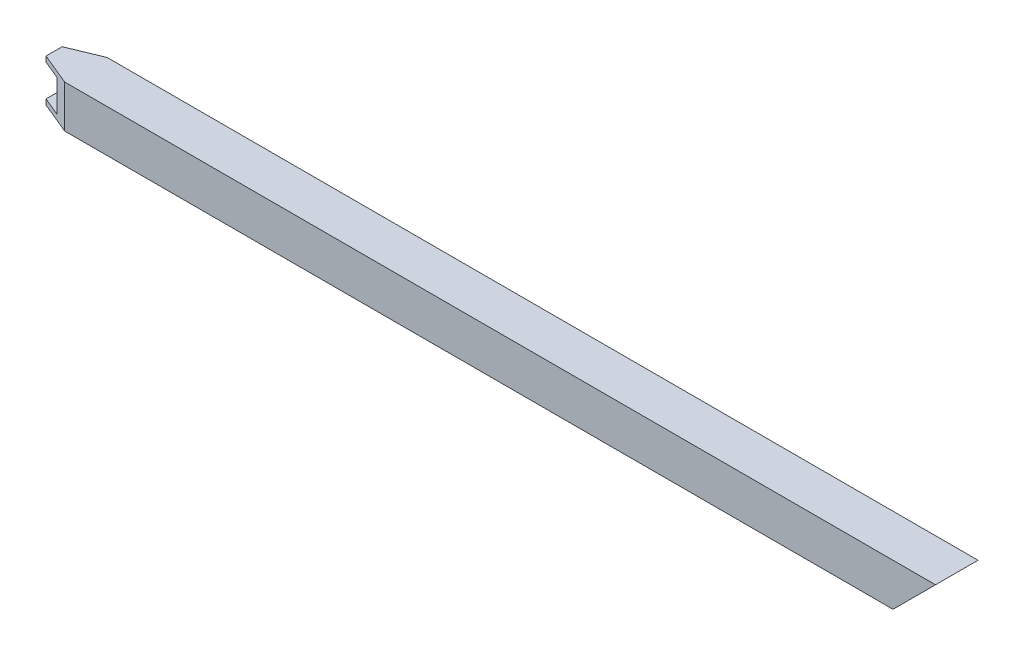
ISO-10303-21;
HEADER;
FILE_DESCRIPTION(('STEP AP214'),'2;1');
FILE_NAME('part.step','',(''),(''),'','','');
FILE_SCHEMA(('AUTOMOTIVE_DESIGN { 1 0 10303 214 1 1 1 1 }'));
ENDSEC;
DATA;
#1=APPLICATION_CONTEXT('core data for automotive mechanical design processes');
#2=APPLICATION_PROTOCOL_DEFINITION('international standard','automotive_design',2000,#1);
#3=PRODUCT_CONTEXT('',#1,'mechanical');
#4=PRODUCT('Part','Part','',(#3));
#5=PRODUCT_RELATED_PRODUCT_CATEGORY('part','',(#4));
#6=PRODUCT_DEFINITION_FORMATION('','',#4);
#7=PRODUCT_DEFINITION_CONTEXT('part definition',#1,'design');
#8=PRODUCT_DEFINITION('design','',#6,#7);
#9=PRODUCT_DEFINITION_SHAPE('','',#8);
#10=(LENGTH_UNIT() NAMED_UNIT(*) SI_UNIT(.MILLI.,.METRE.));
#11=(NAMED_UNIT(*) PLANE_ANGLE_UNIT() SI_UNIT($,.RADIAN.));
#12=(NAMED_UNIT(*) SI_UNIT($,.STERADIAN.) SOLID_ANGLE_UNIT());
#13=UNCERTAINTY_MEASURE_WITH_UNIT(LENGTH_MEASURE(1.E-05),#10,'distance_accuracy_value','');
#14=(GEOMETRIC_REPRESENTATION_CONTEXT(3) GLOBAL_UNCERTAINTY_ASSIGNED_CONTEXT((#13)) GLOBAL_UNIT_ASSIGNED_CONTEXT((#10,
#11,#12)) REPRESENTATION_CONTEXT('',''));
#15=CARTESIAN_POINT('',(0.,0.,0.));
#16=DIRECTION('',(0.,0.,1.));
#17=DIRECTION('',(1.,0.,0.));
#18=AXIS2_PLACEMENT_3D('',#15,#16,#17);
#19=CARTESIAN_POINT('',(539.75,-12.7,-12.7));
#20=DIRECTION('',(0.,0.,1.));
#21=DIRECTION('',(1.,0.,0.));
#22=AXIS2_PLACEMENT_3D('',#19,#20,#21);
#23=PLANE('',#22);
#24=DIRECTION('',(0.,1.,0.));
#25=VECTOR('',#24,1.);
#26=CARTESIAN_POINT('',(19.05,-12.7,-12.7));
#27=LINE('',#26,#25);
#28=CARTESIAN_POINT('',(19.05,-12.7,-12.7));
#29=VERTEX_POINT('',#28);
#30=CARTESIAN_POINT('',(19.05,12.7,-12.7));
#31=VERTEX_POINT('',#30);
#32=EDGE_CURVE('E119',#29,#31,#27,.T.);
#33=ORIENTED_EDGE('',*,*,#32,.T.);
#34=DIRECTION('',(-1.,0.,0.));
#35=VECTOR('',#34,1.);
#36=CARTESIAN_POINT('',(539.75,12.7,-12.7));
#37=LINE('',#36,#35);
#38=CARTESIAN_POINT('',(539.75,12.7,-12.7));
#39=VERTEX_POINT('',#38);
#40=EDGE_CURVE('E40',#39,#31,#37,.T.);
#41=ORIENTED_EDGE('',*,*,#40,.F.);
#42=DIRECTION('',(-0.707106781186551,-0.707106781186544,0.));
#43=VECTOR('',#42,1.);
#44=CARTESIAN_POINT('',(539.75,12.7,-12.7));
#45=LINE('',#44,#43);
#46=CARTESIAN_POINT('',(514.35,-12.7,-12.7));
#47=VERTEX_POINT('',#46);
#48=EDGE_CURVE('E143',#39,#47,#45,.T.);
#49=ORIENTED_EDGE('',*,*,#48,.T.);
#50=DIRECTION('',(-1.,0.,0.));
#51=VECTOR('',#50,1.);
#52=CARTESIAN_POINT('',(539.75,-12.7,-12.7));
#53=LINE('',#52,#51);
#54=EDGE_CURVE('E137',#47,#29,#53,.T.);
#55=ORIENTED_EDGE('',*,*,#54,.T.);
#56=EDGE_LOOP('',(#33,#41,#49,#55));
#57=FACE_BOUND('',#56,.T.);
#58=ADVANCED_FACE('F33',(#57),#23,.F.);
#59=CARTESIAN_POINT('',(539.75,-12.7,12.7));
#60=DIRECTION('',(0.,0.,-1.));
#61=DIRECTION('',(-1.,0.,0.));
#62=AXIS2_PLACEMENT_3D('',#59,#60,#61);
#63=PLANE('',#62);
#64=DIRECTION('',(0.,1.,0.));
#65=VECTOR('',#64,1.);
#66=CARTESIAN_POINT('',(19.05,-12.7,12.7));
#67=LINE('',#66,#65);
#68=CARTESIAN_POINT('',(19.05,-12.7,12.7));
#69=VERTEX_POINT('',#68);
#70=CARTESIAN_POINT('',(19.0500000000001,12.7,12.7));
#71=VERTEX_POINT('',#70);
#72=EDGE_CURVE('E47',#69,#71,#67,.T.);
#73=ORIENTED_EDGE('',*,*,#72,.F.);
#74=DIRECTION('',(-1.,0.,0.));
#75=VECTOR('',#74,1.);
#76=CARTESIAN_POINT('',(539.75,-12.7,12.7));
#77=LINE('',#76,#75);
#78=CARTESIAN_POINT('',(514.35,-12.7,12.7));
#79=VERTEX_POINT('',#78);
#80=EDGE_CURVE('E144',#79,#69,#77,.T.);
#81=ORIENTED_EDGE('',*,*,#80,.F.);
#82=DIRECTION('',(-0.707106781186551,-0.707106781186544,0.));
#83=VECTOR('',#82,1.);
#84=CARTESIAN_POINT('',(539.75,12.7,12.7));
#85=LINE('',#84,#83);
#86=CARTESIAN_POINT('',(539.75,12.7,12.7));
#87=VERTEX_POINT('',#86);
#88=EDGE_CURVE('E164',#87,#79,#85,.T.);
#89=ORIENTED_EDGE('',*,*,#88,.F.);
#90=DIRECTION('',(-1.,0.,0.));
#91=VECTOR('',#90,1.);
#92=CARTESIAN_POINT('',(539.75,12.7,12.7));
#93=LINE('',#92,#91);
#94=EDGE_CURVE('E148',#87,#71,#93,.T.);
#95=ORIENTED_EDGE('',*,*,#94,.T.);
#96=EDGE_LOOP('',(#73,#81,#89,#95));
#97=FACE_BOUND('',#96,.T.);
#98=ADVANCED_FACE('F167',(#97),#63,.F.);
#99=CARTESIAN_POINT('',(539.75,-12.7,12.7));
#100=DIRECTION('',(0.,1.,0.));
#101=DIRECTION('',(0.,0.,1.));
#102=AXIS2_PLACEMENT_3D('',#99,#100,#101);
#103=PLANE('',#102);
#104=DIRECTION('',(0.923879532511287,0.,0.382683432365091));
#105=VECTOR('',#104,1.);
#106=CARTESIAN_POINT('',(19.05,-12.7,12.7));
#107=LINE('',#106,#105);
#108=CARTESIAN_POINT('',(0.,-12.7,4.80923163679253));
#109=VERTEX_POINT('',#108);
#110=EDGE_CURVE('E129',#109,#69,#107,.T.);
#111=ORIENTED_EDGE('',*,*,#110,.F.);
#112=DIRECTION('',(0.,0.,-1.));
#113=VECTOR('',#112,1.);
#114=CARTESIAN_POINT('',(0.,-12.7,12.7));
#115=LINE('',#114,#113);
#116=CARTESIAN_POINT('',(0.,-12.7,-4.80923163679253));
#117=VERTEX_POINT('',#116);
#118=EDGE_CURVE('E139',#109,#117,#115,.T.);
#119=ORIENTED_EDGE('',*,*,#118,.T.);
#120=DIRECTION('',(-0.923879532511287,0.,0.38268343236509));
#121=VECTOR('',#120,1.);
#122=CARTESIAN_POINT('',(0.,-12.7,-4.80923163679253));
#123=LINE('',#122,#121);
#124=EDGE_CURVE('E122',#29,#117,#123,.T.);
#125=ORIENTED_EDGE('',*,*,#124,.F.);
#126=ORIENTED_EDGE('',*,*,#54,.F.);
#127=DIRECTION('',(0.,0.,-1.));
#128=VECTOR('',#127,1.);
#129=CARTESIAN_POINT('',(514.35,-12.7,12.7));
#130=LINE('',#129,#128);
#131=EDGE_CURVE('E168',#79,#47,#130,.T.);
#132=ORIENTED_EDGE('',*,*,#131,.F.);
#133=ORIENTED_EDGE('',*,*,#80,.T.);
#134=EDGE_LOOP('',(#111,#119,#125,#126,#132,#133));
#135=FACE_BOUND('',#134,.T.);
#136=ADVANCED_FACE('F135',(#135),#103,.F.);
#137=CARTESIAN_POINT('',(539.75,-9.52499999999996,-9.52499999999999));
#138=DIRECTION('',(0.,0.,1.));
#139=DIRECTION('',(1.,0.,0.));
#140=AXIS2_PLACEMENT_3D('',#137,#138,#139);
#141=PLANE('',#140);
#142=DIRECTION('',(-1.,0.,0.));
#143=VECTOR('',#142,1.);
#144=CARTESIAN_POINT('',(539.75,9.52499999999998,-9.52499999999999));
#145=LINE('',#144,#143);
#146=CARTESIAN_POINT('',(536.575,9.52499999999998,-9.52499999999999));
#147=VERTEX_POINT('',#146);
#148=CARTESIAN_POINT('',(11.3848719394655,9.52499999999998,-9.52499999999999));
#149=VERTEX_POINT('',#148);
#150=EDGE_CURVE('E200',#147,#149,#145,.T.);
#151=ORIENTED_EDGE('',*,*,#150,.T.);
#152=DIRECTION('',(0.,-1.,0.));
#153=VECTOR('',#152,1.);
#154=CARTESIAN_POINT('',(11.3848719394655,-9.52499999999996,-9.52499999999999));
#155=LINE('',#154,#153);
#156=CARTESIAN_POINT('',(11.3848719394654,-9.52499999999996,-9.52499999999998));
#157=VERTEX_POINT('',#156);
#158=EDGE_CURVE('E220',#149,#157,#155,.T.);
#159=ORIENTED_EDGE('',*,*,#158,.T.);
#160=DIRECTION('',(-1.,0.,0.));
#161=VECTOR('',#160,1.);
#162=CARTESIAN_POINT('',(539.75,-9.52499999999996,-9.52499999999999));
#163=LINE('',#162,#161);
#164=CARTESIAN_POINT('',(517.525,-9.52499999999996,-9.52499999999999));
#165=VERTEX_POINT('',#164);
#166=EDGE_CURVE('E191',#165,#157,#163,.T.);
#167=ORIENTED_EDGE('',*,*,#166,.F.);
#168=DIRECTION('',(0.707106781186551,0.707106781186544,0.));
#169=VECTOR('',#168,1.);
#170=CARTESIAN_POINT('',(528.6375,1.58750000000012,-9.52499999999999));
#171=LINE('',#170,#169);
#172=EDGE_CURVE('E182',#165,#147,#171,.T.);
#173=ORIENTED_EDGE('',*,*,#172,.T.);
#174=EDGE_LOOP('',(#151,#159,#167,#173));
#175=FACE_BOUND('',#174,.T.);
#176=ADVANCED_FACE('F243',(#175),#141,.T.);
#177=CARTESIAN_POINT('',(539.75,9.52499999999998,9.52500000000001));
#178=DIRECTION('',(0.,-1.,0.));
#179=DIRECTION('',(0.,0.,-1.));
#180=AXIS2_PLACEMENT_3D('',#177,#178,#179);
#181=PLANE('',#180);
#182=DIRECTION('',(-1.,0.,0.));
#183=VECTOR('',#182,1.);
#184=CARTESIAN_POINT('',(539.75,9.52499999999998,9.52500000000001));
#185=LINE('',#184,#183);
#186=CARTESIAN_POINT('',(536.575,9.52499999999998,9.52500000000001));
#187=VERTEX_POINT('',#186);
#188=CARTESIAN_POINT('',(11.3848719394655,9.52499999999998,9.52500000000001));
#189=VERTEX_POINT('',#188);
#190=EDGE_CURVE('E197',#187,#189,#185,.T.);
#191=ORIENTED_EDGE('',*,*,#190,.T.);
#192=DIRECTION('',(-0.923879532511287,0.,-0.382683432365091));
#193=VECTOR('',#192,1.);
#194=CARTESIAN_POINT('',(462.372718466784,9.52499999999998,196.330282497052));
#195=LINE('',#194,#193);
#196=CARTESIAN_POINT('',(0.,9.52499999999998,4.80923163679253));
#197=VERTEX_POINT('',#196);
#198=EDGE_CURVE('E172',#189,#197,#195,.T.);
#199=ORIENTED_EDGE('',*,*,#198,.T.);
#200=DIRECTION('',(0.,0.,1.));
#201=VECTOR('',#200,1.);
#202=CARTESIAN_POINT('',(0.,9.52499999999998,9.52500000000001));
#203=LINE('',#202,#201);
#204=CARTESIAN_POINT('',(0.,9.52499999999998,-4.80923163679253));
#205=VERTEX_POINT('',#204);
#206=EDGE_CURVE('E185',#205,#197,#203,.T.);
#207=ORIENTED_EDGE('',*,*,#206,.F.);
#208=DIRECTION('',(0.923879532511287,0.,-0.38268343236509));
#209=VECTOR('',#208,1.);
#210=CARTESIAN_POINT('',(455.637526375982,9.52499999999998,-193.540474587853));
#211=LINE('',#210,#209);
#212=EDGE_CURVE('E223',#205,#149,#211,.T.);
#213=ORIENTED_EDGE('',*,*,#212,.T.);
#214=ORIENTED_EDGE('',*,*,#150,.F.);
#215=DIRECTION('',(0.,0.,1.));
#216=VECTOR('',#215,1.);
#217=CARTESIAN_POINT('',(536.575,9.52499999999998,9.52500000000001));
#218=LINE('',#217,#216);
#219=EDGE_CURVE('E179',#147,#187,#218,.T.);
#220=ORIENTED_EDGE('',*,*,#219,.T.);
#221=EDGE_LOOP('',(#191,#199,#207,#213,#214,#220));
#222=FACE_BOUND('',#221,.T.);
#223=ADVANCED_FACE('F233',(#222),#181,.T.);
#224=CARTESIAN_POINT('',(539.75,-9.52499999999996,9.52500000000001));
#225=DIRECTION('',(0.,0.,-1.));
#226=DIRECTION('',(-1.,0.,0.));
#227=AXIS2_PLACEMENT_3D('',#224,#225,#226);
#228=PLANE('',#227);
#229=DIRECTION('',(-1.,0.,0.));
#230=VECTOR('',#229,1.);
#231=CARTESIAN_POINT('',(539.75,-9.52499999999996,9.52500000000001));
#232=LINE('',#231,#230);
#233=CARTESIAN_POINT('',(517.525,-9.52499999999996,9.52500000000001));
#234=VERTEX_POINT('',#233);
#235=CARTESIAN_POINT('',(11.3848719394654,-9.52499999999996,9.52500000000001));
#236=VERTEX_POINT('',#235);
#237=EDGE_CURVE('E194',#234,#236,#232,.T.);
#238=ORIENTED_EDGE('',*,*,#237,.T.);
#239=DIRECTION('',(0.,1.,0.));
#240=VECTOR('',#239,1.);
#241=CARTESIAN_POINT('',(11.3848719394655,-9.52499999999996,9.52500000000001));
#242=LINE('',#241,#240);
#243=EDGE_CURVE('E228',#236,#189,#242,.T.);
#244=ORIENTED_EDGE('',*,*,#243,.T.);
#245=ORIENTED_EDGE('',*,*,#190,.F.);
#246=DIRECTION('',(-0.707106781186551,-0.707106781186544,0.));
#247=VECTOR('',#246,1.);
#248=CARTESIAN_POINT('',(528.6375,1.58750000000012,9.52500000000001));
#249=LINE('',#248,#247);
#250=EDGE_CURVE('E170',#187,#234,#249,.T.);
#251=ORIENTED_EDGE('',*,*,#250,.T.);
#252=EDGE_LOOP('',(#238,#244,#245,#251));
#253=FACE_BOUND('',#252,.T.);
#254=ADVANCED_FACE('F239',(#253),#228,.T.);
#255=CARTESIAN_POINT('',(539.75,-9.52499999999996,9.52500000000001));
#256=DIRECTION('',(0.,1.,0.));
#257=DIRECTION('',(0.,0.,1.));
#258=AXIS2_PLACEMENT_3D('',#255,#256,#257);
#259=PLANE('',#258);
#260=DIRECTION('',(0.,0.,-1.));
#261=VECTOR('',#260,1.);
#262=CARTESIAN_POINT('',(0.,-9.52499999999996,9.52500000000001));
#263=LINE('',#262,#261);
#264=CARTESIAN_POINT('',(0.,-9.52499999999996,4.80923163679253));
#265=VERTEX_POINT('',#264);
#266=CARTESIAN_POINT('',(0.,-9.52499999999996,-4.80923163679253));
#267=VERTEX_POINT('',#266);
#268=EDGE_CURVE('E188',#265,#267,#263,.T.);
#269=ORIENTED_EDGE('',*,*,#268,.F.);
#270=DIRECTION('',(0.923879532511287,0.,0.382683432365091));
#271=VECTOR('',#270,1.);
#272=CARTESIAN_POINT('',(462.372718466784,-9.52499999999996,196.330282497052));
#273=LINE('',#272,#271);
#274=EDGE_CURVE('E226',#265,#236,#273,.T.);
#275=ORIENTED_EDGE('',*,*,#274,.T.);
#276=ORIENTED_EDGE('',*,*,#237,.F.);
#277=DIRECTION('',(0.,0.,-1.));
#278=VECTOR('',#277,1.);
#279=CARTESIAN_POINT('',(517.525,-9.52499999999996,9.52500000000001));
#280=LINE('',#279,#278);
#281=EDGE_CURVE('E12',#234,#165,#280,.T.);
#282=ORIENTED_EDGE('',*,*,#281,.T.);
#283=ORIENTED_EDGE('',*,*,#166,.T.);
#284=DIRECTION('',(-0.923879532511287,0.,0.38268343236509));
#285=VECTOR('',#284,1.);
#286=CARTESIAN_POINT('',(455.637526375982,-9.52499999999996,-193.540474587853));
#287=LINE('',#286,#285);
#288=EDGE_CURVE('E217',#157,#267,#287,.T.);
#289=ORIENTED_EDGE('',*,*,#288,.T.);
#290=EDGE_LOOP('',(#269,#275,#276,#282,#283,#289));
#291=FACE_BOUND('',#290,.T.);
#292=ADVANCED_FACE('F238',(#291),#259,.T.);
#293=CARTESIAN_POINT('',(0.,12.7,-12.7));
#294=DIRECTION('',(-1.,0.,0.));
#295=DIRECTION('',(0.,0.,1.));
#296=AXIS2_PLACEMENT_3D('',#293,#294,#295);
#297=PLANE('',#296);
#298=ORIENTED_EDGE('',*,*,#118,.F.);
#299=DIRECTION('',(0.,1.,0.));
#300=VECTOR('',#299,1.);
#301=CARTESIAN_POINT('',(0.,-12.7,4.80923163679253));
#302=LINE('',#301,#300);
#303=EDGE_CURVE('E209',#109,#265,#302,.T.);
#304=ORIENTED_EDGE('',*,*,#303,.T.);
#305=ORIENTED_EDGE('',*,*,#268,.T.);
#306=DIRECTION('',(0.,1.,0.));
#307=VECTOR('',#306,1.);
#308=CARTESIAN_POINT('',(0.,-12.7,-4.80923163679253));
#309=LINE('',#308,#307);
#310=EDGE_CURVE('E210',#117,#267,#309,.T.);
#311=ORIENTED_EDGE('',*,*,#310,.F.);
#312=EDGE_LOOP('',(#298,#304,#305,#311));
#313=FACE_BOUND('',#312,.T.);
#314=ADVANCED_FACE('F246',(#313),#297,.T.);
#315=ORIENTED_EDGE('',*,*,#206,.T.);
#316=CARTESIAN_POINT('',(0.,12.7,4.80923163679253));
#317=VERTEX_POINT('',#316);
#318=EDGE_CURVE('E207',#197,#317,#302,.T.);
#319=ORIENTED_EDGE('',*,*,#318,.T.);
#320=DIRECTION('',(0.,0.,1.));
#321=VECTOR('',#320,1.);
#322=CARTESIAN_POINT('',(0.,12.7,12.7));
#323=LINE('',#322,#321);
#324=CARTESIAN_POINT('',(0.,12.7,-4.80923163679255));
#325=VERTEX_POINT('',#324);
#326=EDGE_CURVE('E202',#325,#317,#323,.T.);
#327=ORIENTED_EDGE('',*,*,#326,.F.);
#328=EDGE_CURVE('E55',#205,#325,#309,.T.);
#329=ORIENTED_EDGE('',*,*,#328,.F.);
#330=EDGE_LOOP('',(#315,#319,#327,#329));
#331=FACE_BOUND('',#330,.T.);
#332=ADVANCED_FACE('F205',(#331),#297,.T.);
#333=CARTESIAN_POINT('',(539.75,12.7,12.7));
#334=DIRECTION('',(0.,-1.,0.));
#335=DIRECTION('',(0.,0.,-1.));
#336=AXIS2_PLACEMENT_3D('',#333,#334,#335);
#337=PLANE('',#336);
#338=DIRECTION('',(0.923879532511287,0.,0.382683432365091));
#339=VECTOR('',#338,1.);
#340=CARTESIAN_POINT('',(19.05,12.7,12.7));
#341=LINE('',#340,#339);
#342=EDGE_CURVE('E140',#317,#71,#341,.T.);
#343=ORIENTED_EDGE('',*,*,#342,.T.);
#344=ORIENTED_EDGE('',*,*,#94,.F.);
#345=DIRECTION('',(0.,0.,1.));
#346=VECTOR('',#345,1.);
#347=CARTESIAN_POINT('',(539.75,12.7,12.7));
#348=LINE('',#347,#346);
#349=EDGE_CURVE('E145',#39,#87,#348,.T.);
#350=ORIENTED_EDGE('',*,*,#349,.F.);
#351=ORIENTED_EDGE('',*,*,#40,.T.);
#352=DIRECTION('',(-0.923879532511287,0.,0.38268343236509));
#353=VECTOR('',#352,1.);
#354=CARTESIAN_POINT('',(0.,12.7,-4.80923163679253));
#355=LINE('',#354,#353);
#356=EDGE_CURVE('E124',#31,#325,#355,.T.);
#357=ORIENTED_EDGE('',*,*,#356,.T.);
#358=ORIENTED_EDGE('',*,*,#326,.T.);
#359=EDGE_LOOP('',(#343,#344,#350,#351,#357,#358));
#360=FACE_BOUND('',#359,.T.);
#361=ADVANCED_FACE('F157',(#360),#337,.F.);
#362=CARTESIAN_POINT('',(539.75,12.7,12.7));
#363=DIRECTION('',(0.707106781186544,-0.707106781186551,0.));
#364=DIRECTION('',(0.707106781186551,0.707106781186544,0.));
#365=AXIS2_PLACEMENT_3D('',#362,#363,#364);
#366=PLANE('',#365);
#367=ORIENTED_EDGE('',*,*,#281,.F.);
#368=ORIENTED_EDGE('',*,*,#250,.F.);
#369=ORIENTED_EDGE('',*,*,#219,.F.);
#370=ORIENTED_EDGE('',*,*,#172,.F.);
#371=EDGE_LOOP('',(#367,#368,#369,#370));
#372=FACE_BOUND('',#371,.T.);
#373=ORIENTED_EDGE('',*,*,#48,.F.);
#374=ORIENTED_EDGE('',*,*,#349,.T.);
#375=ORIENTED_EDGE('',*,*,#88,.T.);
#376=ORIENTED_EDGE('',*,*,#131,.T.);
#377=EDGE_LOOP('',(#373,#374,#375,#376));
#378=FACE_BOUND('',#377,.T.);
#379=ADVANCED_FACE('F163',(#372,#378),#366,.T.);
#380=CARTESIAN_POINT('',(0.,-12.7,-4.80923163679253));
#381=DIRECTION('',(-0.38268343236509,0.,-0.923879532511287));
#382=DIRECTION('',(-0.923879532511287,0.,0.38268343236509));
#383=AXIS2_PLACEMENT_3D('',#380,#381,#382);
#384=PLANE('',#383);
#385=ORIENTED_EDGE('',*,*,#328,.T.);
#386=ORIENTED_EDGE('',*,*,#356,.F.);
#387=ORIENTED_EDGE('',*,*,#32,.F.);
#388=ORIENTED_EDGE('',*,*,#124,.T.);
#389=ORIENTED_EDGE('',*,*,#310,.T.);
#390=ORIENTED_EDGE('',*,*,#288,.F.);
#391=ORIENTED_EDGE('',*,*,#158,.F.);
#392=ORIENTED_EDGE('',*,*,#212,.F.);
#393=EDGE_LOOP('',(#385,#386,#387,#388,#389,#390,#391,#392));
#394=FACE_BOUND('',#393,.T.);
#395=ADVANCED_FACE('F121',(#394),#384,.T.);
#396=CARTESIAN_POINT('',(19.05,-12.7,12.7));
#397=DIRECTION('',(-0.382683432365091,0.,0.923879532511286));
#398=DIRECTION('',(0.923879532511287,0.,0.382683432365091));
#399=AXIS2_PLACEMENT_3D('',#396,#397,#398);
#400=PLANE('',#399);
#401=ORIENTED_EDGE('',*,*,#243,.F.);
#402=ORIENTED_EDGE('',*,*,#274,.F.);
#403=ORIENTED_EDGE('',*,*,#303,.F.);
#404=ORIENTED_EDGE('',*,*,#110,.T.);
#405=ORIENTED_EDGE('',*,*,#72,.T.);
#406=ORIENTED_EDGE('',*,*,#342,.F.);
#407=ORIENTED_EDGE('',*,*,#318,.F.);
#408=ORIENTED_EDGE('',*,*,#198,.F.);
#409=EDGE_LOOP('',(#401,#402,#403,#404,#405,#406,#407,#408));
#410=FACE_BOUND('',#409,.T.);
#411=ADVANCED_FACE('F234',(#410),#400,.T.);
#412=CLOSED_SHELL('',(#58,#98,#136,#176,#223,#254,#292,#314,#332,#361,#379,#395,#411));
#413=MANIFOLD_SOLID_BREP('B2',#412);
#414=ADVANCED_BREP_SHAPE_REPRESENTATION('',(#18,#413),#14);
#415=SHAPE_DEFINITION_REPRESENTATION(#9,#414);
ENDSEC;
END-ISO-10303-21;
